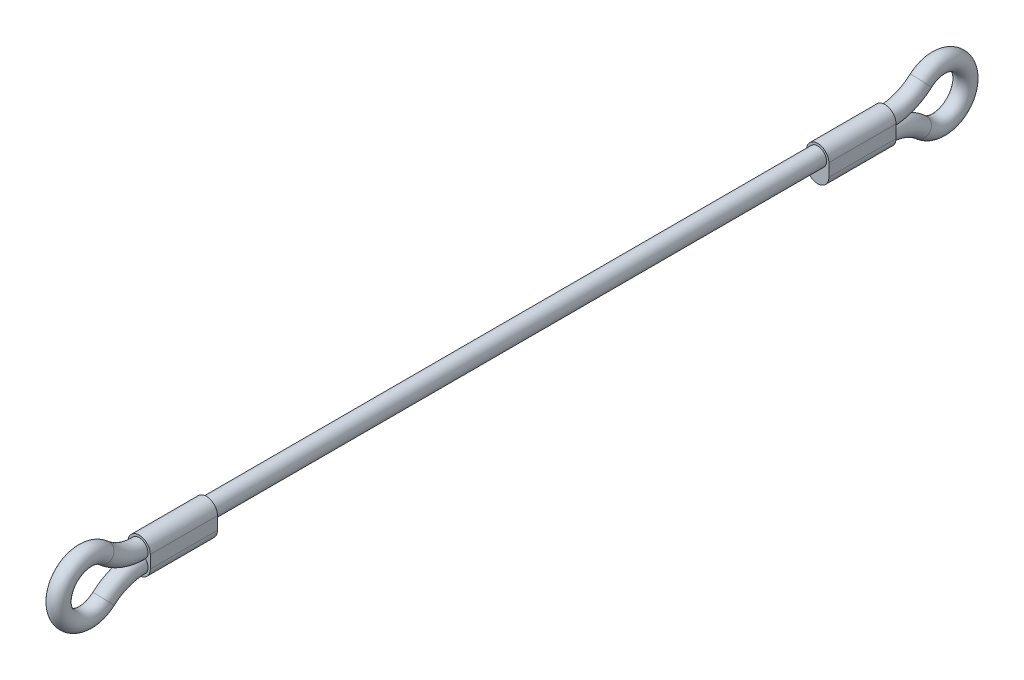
ISO-10303-21;
HEADER;
FILE_DESCRIPTION(('STEP AP214'),'2;1');
FILE_NAME('part.step','',(''),(''),'','','');
FILE_SCHEMA(('AUTOMOTIVE_DESIGN { 1 0 10303 214 1 1 1 1 }'));
ENDSEC;
DATA;
#1=APPLICATION_CONTEXT('core data for automotive mechanical design processes');
#2=APPLICATION_PROTOCOL_DEFINITION('international standard','automotive_design',2000,#1);
#3=PRODUCT_CONTEXT('',#1,'mechanical');
#4=PRODUCT('Part','Part','',(#3));
#5=PRODUCT_RELATED_PRODUCT_CATEGORY('part','',(#4));
#6=PRODUCT_DEFINITION_FORMATION('','',#4);
#7=PRODUCT_DEFINITION_CONTEXT('part definition',#1,'design');
#8=PRODUCT_DEFINITION('design','',#6,#7);
#9=PRODUCT_DEFINITION_SHAPE('','',#8);
#10=(LENGTH_UNIT() NAMED_UNIT(*) SI_UNIT(.MILLI.,.METRE.));
#11=(NAMED_UNIT(*) PLANE_ANGLE_UNIT() SI_UNIT($,.RADIAN.));
#12=(NAMED_UNIT(*) SI_UNIT($,.STERADIAN.) SOLID_ANGLE_UNIT());
#13=UNCERTAINTY_MEASURE_WITH_UNIT(LENGTH_MEASURE(1.E-05),#10,'distance_accuracy_value','');
#14=(GEOMETRIC_REPRESENTATION_CONTEXT(3) GLOBAL_UNCERTAINTY_ASSIGNED_CONTEXT((#13)) GLOBAL_UNIT_ASSIGNED_CONTEXT((#10,
#11,#12)) REPRESENTATION_CONTEXT('',''));
#15=CARTESIAN_POINT('',(0.,0.,0.));
#16=DIRECTION('',(0.,0.,1.));
#17=DIRECTION('',(1.,0.,0.));
#18=AXIS2_PLACEMENT_3D('',#15,#16,#17);
#19=CARTESIAN_POINT('',(0.,0.,-66.6));
#20=DIRECTION('',(0.,0.,1.));
#21=DIRECTION('',(1.,0.,0.));
#22=AXIS2_PLACEMENT_3D('',#19,#20,#21);
#23=CYLINDRICAL_SURFACE('',#22,1.59);
#24=CARTESIAN_POINT('',(0.,0.,-54.6));
#25=DIRECTION('',(0.,0.,1.));
#26=DIRECTION('',(0.,-1.,0.));
#27=AXIS2_PLACEMENT_3D('',#24,#25,#26);
#28=CIRCLE('',#27,1.59);
#29=CARTESIAN_POINT('',(0.,-1.59,-54.6));
#30=VERTEX_POINT('',#29);
#31=EDGE_CURVE('E11',#30,#30,#28,.F.);
#32=ORIENTED_EDGE('',*,*,#31,.F.);
#33=EDGE_LOOP('',(#32));
#34=FACE_BOUND('',#33,.T.);
#35=CARTESIAN_POINT('',(0.,0.,54.6));
#36=DIRECTION('',(0.,0.,-1.));
#37=DIRECTION('',(0.,1.,0.));
#38=AXIS2_PLACEMENT_3D('',#35,#36,#37);
#39=CIRCLE('',#38,1.59);
#40=CARTESIAN_POINT('',(0.,1.59,54.6));
#41=VERTEX_POINT('',#40);
#42=EDGE_CURVE('E51',#41,#41,#39,.F.);
#43=ORIENTED_EDGE('',*,*,#42,.F.);
#44=EDGE_LOOP('',(#43));
#45=FACE_BOUND('',#44,.T.);
#46=ADVANCED_FACE('F41',(#34,#45),#23,.T.);
#47=CARTESIAN_POINT('',(0.,0.,54.6));
#48=DIRECTION('',(0.,0.,1.));
#49=DIRECTION('',(0.,-1.,0.));
#50=AXIS2_PLACEMENT_3D('',#47,#48,#49);
#51=CYLINDRICAL_SURFACE('',#50,1.995);
#52=CARTESIAN_POINT('',(0.,0.,66.6));
#53=DIRECTION('',(0.,0.,-1.));
#54=DIRECTION('',(0.,1.,0.));
#55=AXIS2_PLACEMENT_3D('',#52,#53,#54);
#56=CIRCLE('',#55,1.995);
#57=CARTESIAN_POINT('',(-1.995,0.,66.6));
#58=VERTEX_POINT('',#57);
#59=CARTESIAN_POINT('',(1.995,0.,66.6));
#60=VERTEX_POINT('',#59);
#61=EDGE_CURVE('E134',#58,#60,#56,.T.);
#62=ORIENTED_EDGE('',*,*,#61,.T.);
#63=DIRECTION('',(0.,0.,1.));
#64=VECTOR('',#63,1.);
#65=CARTESIAN_POINT('',(1.995,0.,54.6));
#66=LINE('',#65,#64);
#67=CARTESIAN_POINT('',(1.995,0.,54.6));
#68=VERTEX_POINT('',#67);
#69=EDGE_CURVE('E214',#68,#60,#66,.T.);
#70=ORIENTED_EDGE('',*,*,#69,.F.);
#71=CARTESIAN_POINT('',(0.,0.,54.6));
#72=DIRECTION('',(0.,0.,-1.));
#73=DIRECTION('',(0.,1.,0.));
#74=AXIS2_PLACEMENT_3D('',#71,#72,#73);
#75=CIRCLE('',#74,1.995);
#76=CARTESIAN_POINT('',(-1.995,0.,54.6));
#77=VERTEX_POINT('',#76);
#78=EDGE_CURVE('E178',#77,#68,#75,.T.);
#79=ORIENTED_EDGE('',*,*,#78,.F.);
#80=DIRECTION('',(0.,0.,1.));
#81=VECTOR('',#80,1.);
#82=CARTESIAN_POINT('',(-1.995,0.,54.6));
#83=LINE('',#82,#81);
#84=EDGE_CURVE('E191',#77,#58,#83,.T.);
#85=ORIENTED_EDGE('',*,*,#84,.T.);
#86=EDGE_LOOP('',(#62,#70,#79,#85));
#87=FACE_BOUND('',#86,.T.);
#88=ADVANCED_FACE('F278',(#87),#51,.T.);
#89=CARTESIAN_POINT('',(1.995,0.,54.6));
#90=DIRECTION('',(-1.,0.,0.));
#91=DIRECTION('',(0.,0.,1.));
#92=AXIS2_PLACEMENT_3D('',#89,#90,#91);
#93=PLANE('',#92);
#94=DIRECTION('',(0.,-1.,0.));
#95=VECTOR('',#94,1.);
#96=CARTESIAN_POINT('',(1.995,0.,66.6));
#97=LINE('',#96,#95);
#98=CARTESIAN_POINT('',(1.995,-2.26625258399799,66.6));
#99=VERTEX_POINT('',#98);
#100=EDGE_CURVE('E195',#60,#99,#97,.T.);
#101=ORIENTED_EDGE('',*,*,#100,.T.);
#102=DIRECTION('',(0.,0.,1.));
#103=VECTOR('',#102,1.);
#104=CARTESIAN_POINT('',(1.995,-2.26625258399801,54.6));
#105=LINE('',#104,#103);
#106=CARTESIAN_POINT('',(1.995,-2.26625258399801,54.6));
#107=VERTEX_POINT('',#106);
#108=EDGE_CURVE('E210',#107,#99,#105,.T.);
#109=ORIENTED_EDGE('',*,*,#108,.F.);
#110=DIRECTION('',(0.,-1.,0.));
#111=VECTOR('',#110,1.);
#112=CARTESIAN_POINT('',(1.995,0.,54.6));
#113=LINE('',#112,#111);
#114=EDGE_CURVE('E182',#68,#107,#113,.T.);
#115=ORIENTED_EDGE('',*,*,#114,.F.);
#116=ORIENTED_EDGE('',*,*,#69,.T.);
#117=EDGE_LOOP('',(#101,#109,#115,#116));
#118=FACE_BOUND('',#117,.T.);
#119=ADVANCED_FACE('F283',(#118),#93,.F.);
#120=CARTESIAN_POINT('',(0.,-2.26625258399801,54.6));
#121=DIRECTION('',(0.,0.,1.));
#122=DIRECTION('',(0.,-1.,0.));
#123=AXIS2_PLACEMENT_3D('',#120,#121,#122);
#124=CYLINDRICAL_SURFACE('',#123,1.995);
#125=CARTESIAN_POINT('',(0.,-2.26625258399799,66.6));
#126=DIRECTION('',(0.,0.,-1.));
#127=DIRECTION('',(0.,1.,0.));
#128=AXIS2_PLACEMENT_3D('',#125,#126,#127);
#129=CIRCLE('',#128,1.995);
#130=CARTESIAN_POINT('',(-1.995,-2.26625258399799,66.6));
#131=VERTEX_POINT('',#130);
#132=EDGE_CURVE('E198',#99,#131,#129,.T.);
#133=ORIENTED_EDGE('',*,*,#132,.T.);
#134=DIRECTION('',(0.,0.,1.));
#135=VECTOR('',#134,1.);
#136=CARTESIAN_POINT('',(-1.995,-2.26625258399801,54.6));
#137=LINE('',#136,#135);
#138=CARTESIAN_POINT('',(-1.995,-2.26625258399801,54.6));
#139=VERTEX_POINT('',#138);
#140=EDGE_CURVE('E206',#139,#131,#137,.T.);
#141=ORIENTED_EDGE('',*,*,#140,.F.);
#142=CARTESIAN_POINT('',(0.,-2.26625258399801,54.6));
#143=DIRECTION('',(0.,0.,-1.));
#144=DIRECTION('',(0.,1.,0.));
#145=AXIS2_PLACEMENT_3D('',#142,#143,#144);
#146=CIRCLE('',#145,1.995);
#147=EDGE_CURVE('E186',#107,#139,#146,.T.);
#148=ORIENTED_EDGE('',*,*,#147,.F.);
#149=ORIENTED_EDGE('',*,*,#108,.T.);
#150=EDGE_LOOP('',(#133,#141,#148,#149));
#151=FACE_BOUND('',#150,.T.);
#152=ADVANCED_FACE('F324',(#151),#124,.T.);
#153=CARTESIAN_POINT('',(-1.995,0.,54.6));
#154=DIRECTION('',(1.,0.,0.));
#155=DIRECTION('',(0.,1.,0.));
#156=AXIS2_PLACEMENT_3D('',#153,#154,#155);
#157=PLANE('',#156);
#158=DIRECTION('',(0.,1.,0.));
#159=VECTOR('',#158,1.);
#160=CARTESIAN_POINT('',(-1.995,0.,66.6));
#161=LINE('',#160,#159);
#162=EDGE_CURVE('E183',#131,#58,#161,.T.);
#163=ORIENTED_EDGE('',*,*,#162,.T.);
#164=ORIENTED_EDGE('',*,*,#84,.F.);
#165=DIRECTION('',(0.,1.,0.));
#166=VECTOR('',#165,1.);
#167=CARTESIAN_POINT('',(-1.995,0.,54.6));
#168=LINE('',#167,#166);
#169=EDGE_CURVE('E189',#139,#77,#168,.T.);
#170=ORIENTED_EDGE('',*,*,#169,.F.);
#171=ORIENTED_EDGE('',*,*,#140,.T.);
#172=EDGE_LOOP('',(#163,#164,#170,#171));
#173=FACE_BOUND('',#172,.T.);
#174=ADVANCED_FACE('F320',(#173),#157,.F.);
#175=CARTESIAN_POINT('',(0.,0.,54.6));
#176=DIRECTION('',(0.,0.,-1.));
#177=DIRECTION('',(0.,1.,0.));
#178=AXIS2_PLACEMENT_3D('',#175,#176,#177);
#179=PLANE('',#178);
#180=ORIENTED_EDGE('',*,*,#42,.T.);
#181=EDGE_LOOP('',(#180));
#182=FACE_BOUND('',#181,.T.);
#183=ORIENTED_EDGE('',*,*,#78,.T.);
#184=ORIENTED_EDGE('',*,*,#114,.T.);
#185=ORIENTED_EDGE('',*,*,#147,.T.);
#186=ORIENTED_EDGE('',*,*,#169,.T.);
#187=EDGE_LOOP('',(#183,#184,#185,#186));
#188=FACE_BOUND('',#187,.T.);
#189=ADVANCED_FACE('F272',(#182,#188),#179,.T.);
#190=CARTESIAN_POINT('',(0.,0.,66.6));
#191=DIRECTION('',(0.,0.,-1.));
#192=DIRECTION('',(0.,1.,0.));
#193=AXIS2_PLACEMENT_3D('',#190,#191,#192);
#194=PLANE('',#193);
#195=CARTESIAN_POINT('',(0.,0.,66.6));
#196=DIRECTION('',(0.,0.,1.));
#197=DIRECTION('',(1.,0.,0.));
#198=AXIS2_PLACEMENT_3D('',#195,#196,#197);
#199=CIRCLE('',#198,1.59);
#200=CARTESIAN_POINT('',(1.11540342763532,-1.13312629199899,66.6));
#201=VERTEX_POINT('',#200);
#202=CARTESIAN_POINT('',(-1.11540342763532,-1.133126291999,66.6));
#203=VERTEX_POINT('',#202);
#204=EDGE_CURVE('E231',#201,#203,#199,.T.);
#205=ORIENTED_EDGE('',*,*,#204,.F.);
#206=CARTESIAN_POINT('',(0.,-2.26625258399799,66.6));
#207=DIRECTION('',(0.,0.,-1.));
#208=DIRECTION('',(1.,0.,0.));
#209=AXIS2_PLACEMENT_3D('',#206,#207,#208);
#210=CIRCLE('',#209,1.59);
#211=EDGE_CURVE('E64',#201,#203,#210,.T.);
#212=ORIENTED_EDGE('',*,*,#211,.T.);
#213=EDGE_LOOP('',(#205,#212));
#214=FACE_BOUND('',#213,.T.);
#215=ORIENTED_EDGE('',*,*,#61,.F.);
#216=ORIENTED_EDGE('',*,*,#162,.F.);
#217=ORIENTED_EDGE('',*,*,#132,.F.);
#218=ORIENTED_EDGE('',*,*,#100,.F.);
#219=EDGE_LOOP('',(#215,#216,#217,#218));
#220=FACE_BOUND('',#219,.T.);
#221=ADVANCED_FACE('F266',(#214,#220),#194,.F.);
#222=CARTESIAN_POINT('',(0.,-1.13312629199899,76.2));
#223=DIRECTION('',(1.,0.,0.));
#224=DIRECTION('',(0.,0.,-1.));
#225=AXIS2_PLACEMENT_3D('',#222,#223,#224);
#226=TOROIDAL_SURFACE('',#225,4.8,1.59);
#227=CARTESIAN_POINT('',(0.,2.44458247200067,73.));
#228=DIRECTION('',(0.,0.666666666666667,0.74535599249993));
#229=DIRECTION('',(1.,0.,0.));
#230=AXIS2_PLACEMENT_3D('',#227,#228,#229);
#231=CIRCLE('',#230,1.59);
#232=CARTESIAN_POINT('',(0.,3.62969850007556,71.94));
#233=VERTEX_POINT('',#232);
#234=EDGE_CURVE('E234',#233,#233,#231,.T.);
#235=CARTESIAN_POINT('',(0.,-4.71083505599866,73.));
#236=DIRECTION('',(0.,0.666666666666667,-0.74535599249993));
#237=DIRECTION('',(1.,0.,0.));
#238=AXIS2_PLACEMENT_3D('',#235,#236,#237);
#239=CIRCLE('',#238,1.59);
#240=CARTESIAN_POINT('',(0.,-5.89595108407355,71.94));
#241=VERTEX_POINT('',#240);
#242=EDGE_CURVE('E238',#241,#241,#239,.T.);
#243=CARTESIAN_POINT('',(0.,-1.13312629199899,76.2));
#244=DIRECTION('',(1.,0.,0.));
#245=DIRECTION('',(0.,0.,-1.));
#246=AXIS2_PLACEMENT_3D('',#243,#244,#245);
#247=CIRCLE('',#246,6.39);
#248=EDGE_CURVE('',#233,#241,#247,.T.);
#249=ORIENTED_EDGE('',*,*,#234,.T.);
#250=ORIENTED_EDGE('',*,*,#242,.F.);
#251=ORIENTED_EDGE('',*,*,#248,.T.);
#252=ORIENTED_EDGE('',*,*,#248,.F.);
#253=EDGE_LOOP('',(#249,#251,#250,#252));
#254=FACE_BOUND('',#253,.T.);
#255=ADVANCED_FACE('F264',(#254),#226,.T.);
#256=CARTESIAN_POINT('',(0.,-11.866252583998,66.6));
#257=DIRECTION('',(-1.,0.,0.));
#258=DIRECTION('',(0.,0.,1.));
#259=AXIS2_PLACEMENT_3D('',#256,#257,#258);
#260=TOROIDAL_SURFACE('',#259,9.59999999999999,1.59);
#261=CARTESIAN_POINT('',(-1.11540342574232,-1.13312629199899,66.5998));
#262=CARTESIAN_POINT('',(-1.11534851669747,-1.133126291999,66.72773673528));
#263=CARTESIAN_POINT('',(-1.11308141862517,-1.133126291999,66.8556863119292));
#264=CARTESIAN_POINT('',(-1.10371453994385,-1.133126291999,67.1115582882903));
#265=CARTESIAN_POINT('',(-1.09660901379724,-1.13312629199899,67.2394804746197));
#266=CARTESIAN_POINT('',(-1.07704253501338,-1.13312629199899,67.4964186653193));
#267=CARTESIAN_POINT('',(-1.06452051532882,-1.13312629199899,67.6254301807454));
#268=CARTESIAN_POINT('',(-1.03319430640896,-1.13312629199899,67.8826272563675));
#269=CARTESIAN_POINT('',(-1.01439338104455,-1.13312629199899,68.0108132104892));
#270=CARTESIAN_POINT('',(-0.966908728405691,-1.13312629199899,68.2780053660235));
#271=CARTESIAN_POINT('',(-0.937456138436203,-1.13312629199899,68.4168833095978));
#272=CARTESIAN_POINT('',(-0.883915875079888,-1.13312629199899,68.6226312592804));
#273=CARTESIAN_POINT('',(-0.864530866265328,-1.13312629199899,68.6907246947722));
#274=CARTESIAN_POINT('',(-0.821996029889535,-1.13312629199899,68.8257156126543));
#275=CARTESIAN_POINT('',(-0.79884765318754,-1.13312629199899,68.892613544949));
#276=CARTESIAN_POINT('',(-0.744519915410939,-1.13312629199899,69.0335421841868));
#277=CARTESIAN_POINT('',(-0.712679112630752,-1.13312629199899,69.107321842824));
#278=CARTESIAN_POINT('',(-0.641279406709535,-1.13312629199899,69.2511461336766));
#279=CARTESIAN_POINT('',(-0.601727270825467,-1.13312629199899,69.321193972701));
#280=CARTESIAN_POINT('',(-0.528948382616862,-1.13312629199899,69.4294356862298));
#281=CARTESIAN_POINT('',(-0.498892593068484,-1.13312629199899,69.469741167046));
#282=CARTESIAN_POINT('',(-0.433770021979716,-1.13312629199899,69.5461405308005));
#283=CARTESIAN_POINT('',(-0.39871096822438,-1.13312629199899,69.5822407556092));
#284=CARTESIAN_POINT('',(-0.335060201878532,-1.13312629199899,69.6370580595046));
#285=CARTESIAN_POINT('',(-0.308066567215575,-1.13312629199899,69.6576127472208));
#286=CARTESIAN_POINT('',(-0.251279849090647,-1.13312629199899,69.6944335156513));
#287=CARTESIAN_POINT('',(-0.221491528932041,-1.13312629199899,69.7107067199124));
#288=CARTESIAN_POINT('',(-0.165682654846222,-1.13312629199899,69.7347979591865));
#289=CARTESIAN_POINT('',(-0.140117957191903,-1.13312629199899,69.7436602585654));
#290=CARTESIAN_POINT('',(-0.0878641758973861,-1.13312629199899,69.7569907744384));
#291=CARTESIAN_POINT('',(-0.0611762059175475,-1.13312629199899,69.7614632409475));
#292=CARTESIAN_POINT('',(-0.00731772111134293,-1.13312629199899,69.765572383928));
#293=CARTESIAN_POINT('',(0.0198542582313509,-1.13312629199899,69.7651903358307));
#294=CARTESIAN_POINT('',(0.073695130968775,-1.13312629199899,69.7595861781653));
#295=CARTESIAN_POINT('',(0.100363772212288,-1.13312629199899,69.7543617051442));
#296=CARTESIAN_POINT('',(0.151195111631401,-1.13312629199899,69.7399571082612));
#297=CARTESIAN_POINT('',(0.175416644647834,-1.13312629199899,69.7309793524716));
#298=CARTESIAN_POINT('',(0.222373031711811,-1.13312629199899,69.7097742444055));
#299=CARTESIAN_POINT('',(0.245107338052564,-1.13312629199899,69.6975457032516));
#300=CARTESIAN_POINT('',(0.30475923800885,-1.13312629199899,69.6607488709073));
#301=CARTESIAN_POINT('',(0.340101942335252,-1.13312629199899,69.6336356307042));
#302=CARTESIAN_POINT('',(0.406281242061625,-1.13312629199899,69.57436880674));
#303=CARTESIAN_POINT('',(0.437102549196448,-1.13312629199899,69.5421988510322));
#304=CARTESIAN_POINT('',(0.492718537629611,-1.13312629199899,69.4770136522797));
#305=CARTESIAN_POINT('',(0.517788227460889,-1.13312629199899,69.4442290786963));
#306=CARTESIAN_POINT('',(0.565060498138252,-1.13312629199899,69.3766392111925));
#307=CARTESIAN_POINT('',(0.587260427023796,-1.13312629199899,69.3418320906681));
#308=CARTESIAN_POINT('',(0.650275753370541,-1.13312629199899,69.2351509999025));
#309=CARTESIAN_POINT('',(0.687428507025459,-1.13312629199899,69.1611160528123));
#310=CARTESIAN_POINT('',(0.745434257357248,-1.13312629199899,69.0302751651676));
#311=CARTESIAN_POINT('',(0.767985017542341,-1.13312629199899,68.9741824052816));
#312=CARTESIAN_POINT('',(0.809859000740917,-1.13312629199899,68.8607969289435));
#313=CARTESIAN_POINT('',(0.829181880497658,-1.13312629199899,68.8035040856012));
#314=CARTESIAN_POINT('',(0.883166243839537,-1.13312629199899,68.6301731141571));
#315=CARTESIAN_POINT('',(0.913763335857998,-1.13312629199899,68.5128746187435));
#316=CARTESIAN_POINT('',(0.967023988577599,-1.13312629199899,68.2759552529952));
#317=CARTESIAN_POINT('',(0.989647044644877,-1.13312629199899,68.156325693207));
#318=CARTESIAN_POINT('',(1.02845868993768,-1.13312629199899,67.9160128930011));
#319=CARTESIAN_POINT('',(1.04464572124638,-1.13312629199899,67.7953294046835));
#320=CARTESIAN_POINT('',(1.068187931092,-1.13312629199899,67.5845366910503));
#321=CARTESIAN_POINT('',(1.07674400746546,-1.13312629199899,67.4945564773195));
#322=CARTESIAN_POINT('',(1.09119671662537,-1.13312629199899,67.3143675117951));
#323=CARTESIAN_POINT('',(1.09709289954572,-1.13312629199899,67.2241587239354));
#324=CARTESIAN_POINT('',(1.10635885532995,-1.13312629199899,67.0449391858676));
#325=CARTESIAN_POINT('',(1.10976438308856,-1.13312629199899,66.9559302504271));
#326=CARTESIAN_POINT('',(1.11428069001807,-1.13312629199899,66.7778802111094));
#327=CARTESIAN_POINT('',(1.11539214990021,-1.13312629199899,66.688839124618));
#328=CARTESIAN_POINT('',(1.11540342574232,-1.133126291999,66.5998));
#329=B_SPLINE_CURVE_WITH_KNOTS('',3,(#261,#262,#263,#264,#265,#266,#267,#268,#269,#270,#271,
#272,#273,#274,#275,#276,#277,#278,#279,#280,#281,#282,#283,#284,#285,#286,#287,#288,#289,#290,
#291,#292,#293,#294,#295,#296,#297,#298,#299,#300,#301,#302,#303,#304,#305,#306,#307,#308,#309,
#310,#311,#312,#313,#314,#315,#316,#317,#318,#319,#320,#321,#322,#323,#324,#325,#326,#327,#328),
.UNSPECIFIED.,.F.,.F.,(4,2,2,2,2,2,2,2,2,2,2,2,2,2,2,2,2,2,2,2,2,2,2,2,2,2,2,2,2,2,2,2,2,4),(0.,
0.383810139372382,0.76807684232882,1.15679365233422,1.54530871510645,1.97071269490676,
2.18302701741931,2.39525968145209,2.63604166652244,2.87661329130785,3.02716706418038,
3.17749076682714,3.27898827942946,3.3803158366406,3.46115731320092,3.54192044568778,
3.62299518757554,3.70410952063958,3.78132200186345,3.85856276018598,3.99142265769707,
4.12472192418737,4.24834991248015,4.37209134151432,4.61994843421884,4.80123584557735,
4.98254252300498,5.34577733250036,5.71083149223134,6.07597396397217,6.34709439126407,
6.61826065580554,6.88545336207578,7.15256677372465),.UNSPECIFIED.);
#330=EDGE_CURVE('E244',#203,#201,#329,.T.);
#331=ORIENTED_EDGE('',*,*,#330,.F.);
#332=ORIENTED_EDGE('',*,*,#211,.F.);
#333=EDGE_LOOP('',(#331,#332));
#334=FACE_BOUND('',#333,.T.);
#335=ORIENTED_EDGE('',*,*,#242,.T.);
#336=EDGE_LOOP('',(#335));
#337=FACE_BOUND('',#336,.T.);
#338=ADVANCED_FACE('F43',(#334,#337),#260,.T.);
#339=CARTESIAN_POINT('',(0.,9.59999999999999,66.6));
#340=DIRECTION('',(-1.,0.,0.));
#341=DIRECTION('',(0.,0.,1.));
#342=AXIS2_PLACEMENT_3D('',#339,#340,#341);
#343=TOROIDAL_SURFACE('',#342,9.59999999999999,1.59);
#344=ORIENTED_EDGE('',*,*,#234,.F.);
#345=EDGE_LOOP('',(#344));
#346=FACE_BOUND('',#345,.T.);
#347=ORIENTED_EDGE('',*,*,#204,.T.);
#348=ORIENTED_EDGE('',*,*,#330,.T.);
#349=EDGE_LOOP('',(#347,#348));
#350=FACE_BOUND('',#349,.T.);
#351=ADVANCED_FACE('F259',(#346,#350),#343,.T.);
#352=CARTESIAN_POINT('',(0.,0.,-54.6));
#353=DIRECTION('',(0.,0.,-1.));
#354=DIRECTION('',(0.,1.,0.));
#355=AXIS2_PLACEMENT_3D('',#352,#353,#354);
#356=CYLINDRICAL_SURFACE('',#355,1.995);
#357=CARTESIAN_POINT('',(0.,0.,-66.6));
#358=DIRECTION('',(0.,0.,-1.));
#359=DIRECTION('',(0.,1.,0.));
#360=AXIS2_PLACEMENT_3D('',#357,#358,#359);
#361=CIRCLE('',#360,1.995);
#362=CARTESIAN_POINT('',(-1.995,0.,-66.6));
#363=VERTEX_POINT('',#362);
#364=CARTESIAN_POINT('',(1.995,0.,-66.6));
#365=VERTEX_POINT('',#364);
#366=EDGE_CURVE('E128',#363,#365,#361,.T.);
#367=ORIENTED_EDGE('',*,*,#366,.F.);
#368=DIRECTION('',(0.,0.,-1.));
#369=VECTOR('',#368,1.);
#370=CARTESIAN_POINT('',(-1.995,0.,-54.6));
#371=LINE('',#370,#369);
#372=CARTESIAN_POINT('',(-1.995,0.,-54.6));
#373=VERTEX_POINT('',#372);
#374=EDGE_CURVE('E122',#373,#363,#371,.T.);
#375=ORIENTED_EDGE('',*,*,#374,.F.);
#376=CARTESIAN_POINT('',(0.,0.,-54.6));
#377=DIRECTION('',(0.,0.,-1.));
#378=DIRECTION('',(0.,1.,0.));
#379=AXIS2_PLACEMENT_3D('',#376,#377,#378);
#380=CIRCLE('',#379,1.995);
#381=CARTESIAN_POINT('',(1.995,0.,-54.6));
#382=VERTEX_POINT('',#381);
#383=EDGE_CURVE('E125',#373,#382,#380,.T.);
#384=ORIENTED_EDGE('',*,*,#383,.T.);
#385=DIRECTION('',(0.,0.,-1.));
#386=VECTOR('',#385,1.);
#387=CARTESIAN_POINT('',(1.995,0.,-54.6));
#388=LINE('',#387,#386);
#389=EDGE_CURVE('E158',#382,#365,#388,.T.);
#390=ORIENTED_EDGE('',*,*,#389,.T.);
#391=EDGE_LOOP('',(#367,#375,#384,#390));
#392=FACE_BOUND('',#391,.T.);
#393=ADVANCED_FACE('F124',(#392),#356,.T.);
#394=CARTESIAN_POINT('',(-1.995,0.,-54.6));
#395=DIRECTION('',(-1.,0.,0.));
#396=DIRECTION('',(0.,-1.,0.));
#397=AXIS2_PLACEMENT_3D('',#394,#395,#396);
#398=PLANE('',#397);
#399=DIRECTION('',(0.,1.,0.));
#400=VECTOR('',#399,1.);
#401=CARTESIAN_POINT('',(-1.995,0.,-66.6));
#402=LINE('',#401,#400);
#403=CARTESIAN_POINT('',(-1.995,-2.26625258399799,-66.6));
#404=VERTEX_POINT('',#403);
#405=EDGE_CURVE('E161',#404,#363,#402,.T.);
#406=ORIENTED_EDGE('',*,*,#405,.F.);
#407=DIRECTION('',(0.,0.,-1.));
#408=VECTOR('',#407,1.);
#409=CARTESIAN_POINT('',(-1.995,-2.26625258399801,-54.6));
#410=LINE('',#409,#408);
#411=CARTESIAN_POINT('',(-1.995,-2.26625258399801,-54.6));
#412=VERTEX_POINT('',#411);
#413=EDGE_CURVE('E135',#412,#404,#410,.T.);
#414=ORIENTED_EDGE('',*,*,#413,.F.);
#415=DIRECTION('',(0.,1.,0.));
#416=VECTOR('',#415,1.);
#417=CARTESIAN_POINT('',(-1.995,0.,-54.6));
#418=LINE('',#417,#416);
#419=EDGE_CURVE('E141',#412,#373,#418,.T.);
#420=ORIENTED_EDGE('',*,*,#419,.T.);
#421=ORIENTED_EDGE('',*,*,#374,.T.);
#422=EDGE_LOOP('',(#406,#414,#420,#421));
#423=FACE_BOUND('',#422,.T.);
#424=ADVANCED_FACE('F148',(#423),#398,.T.);
#425=CARTESIAN_POINT('',(0.,-2.26625258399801,-54.6));
#426=DIRECTION('',(0.,0.,-1.));
#427=DIRECTION('',(0.,1.,0.));
#428=AXIS2_PLACEMENT_3D('',#425,#426,#427);
#429=CYLINDRICAL_SURFACE('',#428,1.995);
#430=CARTESIAN_POINT('',(0.,-2.26625258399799,-66.6));
#431=DIRECTION('',(0.,0.,-1.));
#432=DIRECTION('',(0.,1.,0.));
#433=AXIS2_PLACEMENT_3D('',#430,#431,#432);
#434=CIRCLE('',#433,1.995);
#435=CARTESIAN_POINT('',(1.995,-2.26625258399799,-66.6));
#436=VERTEX_POINT('',#435);
#437=EDGE_CURVE('E164',#436,#404,#434,.T.);
#438=ORIENTED_EDGE('',*,*,#437,.F.);
#439=DIRECTION('',(0.,0.,-1.));
#440=VECTOR('',#439,1.);
#441=CARTESIAN_POINT('',(1.995,-2.26625258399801,-54.6));
#442=LINE('',#441,#440);
#443=CARTESIAN_POINT('',(1.995,-2.26625258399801,-54.6));
#444=VERTEX_POINT('',#443);
#445=EDGE_CURVE('E173',#444,#436,#442,.T.);
#446=ORIENTED_EDGE('',*,*,#445,.F.);
#447=CARTESIAN_POINT('',(0.,-2.26625258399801,-54.6));
#448=DIRECTION('',(0.,0.,-1.));
#449=DIRECTION('',(0.,1.,0.));
#450=AXIS2_PLACEMENT_3D('',#447,#448,#449);
#451=CIRCLE('',#450,1.995);
#452=EDGE_CURVE('E150',#444,#412,#451,.T.);
#453=ORIENTED_EDGE('',*,*,#452,.T.);
#454=ORIENTED_EDGE('',*,*,#413,.T.);
#455=EDGE_LOOP('',(#438,#446,#453,#454));
#456=FACE_BOUND('',#455,.T.);
#457=ADVANCED_FACE('F307',(#456),#429,.T.);
#458=CARTESIAN_POINT('',(1.995,0.,-54.6));
#459=DIRECTION('',(1.,0.,0.));
#460=DIRECTION('',(0.,0.,-1.));
#461=AXIS2_PLACEMENT_3D('',#458,#459,#460);
#462=PLANE('',#461);
#463=DIRECTION('',(0.,-1.,0.));
#464=VECTOR('',#463,1.);
#465=CARTESIAN_POINT('',(1.995,0.,-66.6));
#466=LINE('',#465,#464);
#467=EDGE_CURVE('E146',#365,#436,#466,.T.);
#468=ORIENTED_EDGE('',*,*,#467,.F.);
#469=ORIENTED_EDGE('',*,*,#389,.F.);
#470=DIRECTION('',(0.,-1.,0.));
#471=VECTOR('',#470,1.);
#472=CARTESIAN_POINT('',(1.995,0.,-54.6));
#473=LINE('',#472,#471);
#474=EDGE_CURVE('E144',#382,#444,#473,.T.);
#475=ORIENTED_EDGE('',*,*,#474,.T.);
#476=ORIENTED_EDGE('',*,*,#445,.T.);
#477=EDGE_LOOP('',(#468,#469,#475,#476));
#478=FACE_BOUND('',#477,.T.);
#479=ADVANCED_FACE('F304',(#478),#462,.T.);
#480=CARTESIAN_POINT('',(0.,0.,-54.6));
#481=DIRECTION('',(0.,0.,1.));
#482=DIRECTION('',(0.,1.,0.));
#483=AXIS2_PLACEMENT_3D('',#480,#481,#482);
#484=PLANE('',#483);
#485=ORIENTED_EDGE('',*,*,#31,.T.);
#486=EDGE_LOOP('',(#485));
#487=FACE_BOUND('',#486,.T.);
#488=ORIENTED_EDGE('',*,*,#383,.F.);
#489=ORIENTED_EDGE('',*,*,#419,.F.);
#490=ORIENTED_EDGE('',*,*,#452,.F.);
#491=ORIENTED_EDGE('',*,*,#474,.F.);
#492=EDGE_LOOP('',(#488,#489,#490,#491));
#493=FACE_BOUND('',#492,.T.);
#494=ADVANCED_FACE('F139',(#487,#493),#484,.T.);
#495=CARTESIAN_POINT('',(0.,0.,-66.6));
#496=DIRECTION('',(0.,0.,1.));
#497=DIRECTION('',(0.,1.,0.));
#498=AXIS2_PLACEMENT_3D('',#495,#496,#497);
#499=PLANE('',#498);
#500=CARTESIAN_POINT('',(0.,-2.26625258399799,-66.6));
#501=DIRECTION('',(0.,0.,-1.));
#502=DIRECTION('',(1.,0.,0.));
#503=AXIS2_PLACEMENT_3D('',#500,#501,#502);
#504=CIRCLE('',#503,1.59);
#505=CARTESIAN_POINT('',(1.11540342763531,-1.133126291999,-66.6));
#506=VERTEX_POINT('',#505);
#507=CARTESIAN_POINT('',(-1.11540342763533,-1.13312629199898,-66.6));
#508=VERTEX_POINT('',#507);
#509=EDGE_CURVE('E218',#506,#508,#504,.T.);
#510=ORIENTED_EDGE('',*,*,#509,.F.);
#511=CARTESIAN_POINT('',(0.,0.,-66.6));
#512=DIRECTION('',(0.,0.,1.));
#513=DIRECTION('',(1.,0.,0.));
#514=AXIS2_PLACEMENT_3D('',#511,#512,#513);
#515=CIRCLE('',#514,1.59);
#516=EDGE_CURVE('E57',#506,#508,#515,.T.);
#517=ORIENTED_EDGE('',*,*,#516,.T.);
#518=EDGE_LOOP('',(#510,#517));
#519=FACE_BOUND('',#518,.T.);
#520=ORIENTED_EDGE('',*,*,#366,.T.);
#521=ORIENTED_EDGE('',*,*,#467,.T.);
#522=ORIENTED_EDGE('',*,*,#437,.T.);
#523=ORIENTED_EDGE('',*,*,#405,.T.);
#524=EDGE_LOOP('',(#520,#521,#522,#523));
#525=FACE_BOUND('',#524,.T.);
#526=ADVANCED_FACE('F297',(#519,#525),#499,.F.);
#527=CARTESIAN_POINT('',(0.,-1.13312629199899,-76.2));
#528=DIRECTION('',(1.,0.,0.));
#529=DIRECTION('',(0.,0.,-1.));
#530=AXIS2_PLACEMENT_3D('',#527,#528,#529);
#531=TOROIDAL_SURFACE('',#530,4.8,1.59);
#532=CARTESIAN_POINT('',(0.,-4.71083505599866,-73.));
#533=DIRECTION('',(0.,-0.666666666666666,-0.745355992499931));
#534=DIRECTION('',(1.,0.,0.));
#535=AXIS2_PLACEMENT_3D('',#532,#533,#534);
#536=CIRCLE('',#535,1.59);
#537=CARTESIAN_POINT('',(0.,-5.89595108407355,-71.94));
#538=VERTEX_POINT('',#537);
#539=EDGE_CURVE('E221',#538,#538,#536,.T.);
#540=CARTESIAN_POINT('',(0.,2.44458247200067,-73.));
#541=DIRECTION('',(0.,-0.666666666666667,0.74535599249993));
#542=DIRECTION('',(1.,0.,0.));
#543=AXIS2_PLACEMENT_3D('',#540,#541,#542);
#544=CIRCLE('',#543,1.59);
#545=CARTESIAN_POINT('',(0.,3.62969850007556,-71.94));
#546=VERTEX_POINT('',#545);
#547=EDGE_CURVE('E225',#546,#546,#544,.T.);
#548=CARTESIAN_POINT('',(0.,-1.13312629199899,-76.2));
#549=DIRECTION('',(1.,0.,0.));
#550=DIRECTION('',(0.,0.,-1.));
#551=AXIS2_PLACEMENT_3D('',#548,#549,#550);
#552=CIRCLE('',#551,6.39);
#553=EDGE_CURVE('',#538,#546,#552,.T.);
#554=ORIENTED_EDGE('',*,*,#539,.T.);
#555=ORIENTED_EDGE('',*,*,#547,.F.);
#556=ORIENTED_EDGE('',*,*,#553,.T.);
#557=ORIENTED_EDGE('',*,*,#553,.F.);
#558=EDGE_LOOP('',(#554,#556,#555,#557));
#559=FACE_BOUND('',#558,.T.);
#560=ADVANCED_FACE('F300',(#559),#531,.T.);
#561=CARTESIAN_POINT('',(0.,9.59999999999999,-66.6));
#562=DIRECTION('',(-1.,0.,0.));
#563=DIRECTION('',(0.,0.,1.));
#564=AXIS2_PLACEMENT_3D('',#561,#562,#563);
#565=TOROIDAL_SURFACE('',#564,9.6,1.59);
#566=CARTESIAN_POINT('',(-1.11540342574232,-1.133126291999,-66.5998));
#567=CARTESIAN_POINT('',(-1.11534851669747,-1.133126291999,-66.72773673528));
#568=CARTESIAN_POINT('',(-1.11308141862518,-1.133126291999,-66.8556863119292));
#569=CARTESIAN_POINT('',(-1.10371453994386,-1.133126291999,-67.1115582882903));
#570=CARTESIAN_POINT('',(-1.09660901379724,-1.133126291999,-67.2394804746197));
#571=CARTESIAN_POINT('',(-1.07704253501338,-1.133126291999,-67.4964186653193));
#572=CARTESIAN_POINT('',(-1.06452051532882,-1.133126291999,-67.6254301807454));
#573=CARTESIAN_POINT('',(-1.03319430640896,-1.133126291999,-67.8826272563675));
#574=CARTESIAN_POINT('',(-1.01439338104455,-1.133126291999,-68.0108132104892));
#575=CARTESIAN_POINT('',(-0.966908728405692,-1.133126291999,-68.2780053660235));
#576=CARTESIAN_POINT('',(-0.937456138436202,-1.133126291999,-68.4168833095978));
#577=CARTESIAN_POINT('',(-0.883915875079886,-1.133126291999,-68.6226312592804));
#578=CARTESIAN_POINT('',(-0.864530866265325,-1.133126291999,-68.6907246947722));
#579=CARTESIAN_POINT('',(-0.821996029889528,-1.133126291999,-68.8257156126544));
#580=CARTESIAN_POINT('',(-0.798847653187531,-1.133126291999,-68.8926135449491));
#581=CARTESIAN_POINT('',(-0.744519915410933,-1.133126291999,-69.0335421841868));
#582=CARTESIAN_POINT('',(-0.71267911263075,-1.133126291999,-69.107321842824));
#583=CARTESIAN_POINT('',(-0.64127940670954,-1.133126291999,-69.2511461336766));
#584=CARTESIAN_POINT('',(-0.601727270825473,-1.133126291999,-69.321193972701));
#585=CARTESIAN_POINT('',(-0.528948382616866,-1.133126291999,-69.4294356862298));
#586=CARTESIAN_POINT('',(-0.498892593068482,-1.133126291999,-69.469741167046));
#587=CARTESIAN_POINT('',(-0.433770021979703,-1.133126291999,-69.5461405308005));
#588=CARTESIAN_POINT('',(-0.398710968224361,-1.133126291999,-69.5822407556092));
#589=CARTESIAN_POINT('',(-0.335060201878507,-1.133126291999,-69.6370580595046));
#590=CARTESIAN_POINT('',(-0.308066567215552,-1.133126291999,-69.6576127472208));
#591=CARTESIAN_POINT('',(-0.251279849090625,-1.133126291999,-69.6944335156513));
#592=CARTESIAN_POINT('',(-0.221491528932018,-1.133126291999,-69.7107067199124));
#593=CARTESIAN_POINT('',(-0.165682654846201,-1.133126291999,-69.7347979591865));
#594=CARTESIAN_POINT('',(-0.140117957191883,-1.133126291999,-69.7436602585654));
#595=CARTESIAN_POINT('',(-0.0878641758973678,-1.133126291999,-69.7569907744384));
#596=CARTESIAN_POINT('',(-0.0611762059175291,-1.133126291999,-69.7614632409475));
#597=CARTESIAN_POINT('',(-0.00731772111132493,-1.133126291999,-69.765572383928));
#598=CARTESIAN_POINT('',(0.0198542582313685,-1.133126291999,-69.7651903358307));
#599=CARTESIAN_POINT('',(0.0736951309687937,-1.133126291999,-69.7595861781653));
#600=CARTESIAN_POINT('',(0.100363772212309,-1.133126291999,-69.7543617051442));
#601=CARTESIAN_POINT('',(0.15119511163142,-1.133126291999,-69.7399571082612));
#602=CARTESIAN_POINT('',(0.175416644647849,-1.133126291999,-69.7309793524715));
#603=CARTESIAN_POINT('',(0.222373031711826,-1.133126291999,-69.7097742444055));
#604=CARTESIAN_POINT('',(0.245107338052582,-1.133126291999,-69.6975457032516));
#605=CARTESIAN_POINT('',(0.304759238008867,-1.133126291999,-69.6607488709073));
#606=CARTESIAN_POINT('',(0.340101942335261,-1.133126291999,-69.6336356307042));
#607=CARTESIAN_POINT('',(0.406281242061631,-1.133126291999,-69.57436880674));
#608=CARTESIAN_POINT('',(0.43710254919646,-1.133126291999,-69.5421988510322));
#609=CARTESIAN_POINT('',(0.492718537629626,-1.133126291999,-69.4770136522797));
#610=CARTESIAN_POINT('',(0.517788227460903,-1.133126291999,-69.4442290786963));
#611=CARTESIAN_POINT('',(0.565060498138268,-1.133126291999,-69.3766392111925));
#612=CARTESIAN_POINT('',(0.587260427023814,-1.133126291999,-69.3418320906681));
#613=CARTESIAN_POINT('',(0.650275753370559,-1.133126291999,-69.2351509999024));
#614=CARTESIAN_POINT('',(0.687428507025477,-1.133126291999,-69.1611160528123));
#615=CARTESIAN_POINT('',(0.745434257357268,-1.133126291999,-69.0302751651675));
#616=CARTESIAN_POINT('',(0.767985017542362,-1.133126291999,-68.9741824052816));
#617=CARTESIAN_POINT('',(0.809859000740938,-1.133126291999,-68.8607969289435));
#618=CARTESIAN_POINT('',(0.829181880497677,-1.133126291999,-68.8035040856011));
#619=CARTESIAN_POINT('',(0.883166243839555,-1.133126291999,-68.630173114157));
#620=CARTESIAN_POINT('',(0.913763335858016,-1.133126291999,-68.5128746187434));
#621=CARTESIAN_POINT('',(0.967023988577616,-1.133126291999,-68.2759552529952));
#622=CARTESIAN_POINT('',(0.989647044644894,-1.133126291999,-68.1563256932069));
#623=CARTESIAN_POINT('',(1.02845868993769,-1.133126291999,-67.916012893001));
#624=CARTESIAN_POINT('',(1.04464572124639,-1.133126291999,-67.7953294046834));
#625=CARTESIAN_POINT('',(1.06818793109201,-1.133126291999,-67.5845366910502));
#626=CARTESIAN_POINT('',(1.07674400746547,-1.133126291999,-67.4945564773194));
#627=CARTESIAN_POINT('',(1.09119671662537,-1.133126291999,-67.314367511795));
#628=CARTESIAN_POINT('',(1.09709289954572,-1.133126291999,-67.2241587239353));
#629=CARTESIAN_POINT('',(1.10635885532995,-1.133126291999,-67.0449391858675));
#630=CARTESIAN_POINT('',(1.10976438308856,-1.133126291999,-66.9559302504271));
#631=CARTESIAN_POINT('',(1.11428069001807,-1.133126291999,-66.7778802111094));
#632=CARTESIAN_POINT('',(1.11539214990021,-1.133126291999,-66.688839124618));
#633=CARTESIAN_POINT('',(1.11540342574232,-1.133126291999,-66.5998));
#634=B_SPLINE_CURVE_WITH_KNOTS('',3,(#566,#567,#568,#569,#570,#571,#572,#573,#574,#575,#576,
#577,#578,#579,#580,#581,#582,#583,#584,#585,#586,#587,#588,#589,#590,#591,#592,#593,#594,#595,
#596,#597,#598,#599,#600,#601,#602,#603,#604,#605,#606,#607,#608,#609,#610,#611,#612,#613,#614,
#615,#616,#617,#618,#619,#620,#621,#622,#623,#624,#625,#626,#627,#628,#629,#630,#631,#632,#633),
.UNSPECIFIED.,.F.,.F.,(4,2,2,2,2,2,2,2,2,2,2,2,2,2,2,2,2,2,2,2,2,2,2,2,2,2,2,2,2,2,2,2,2,4),(0.,
0.383810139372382,0.76807684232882,1.15679365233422,1.54530871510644,1.97071269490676,
2.18302701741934,2.39525968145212,2.63604166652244,2.87661329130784,3.02716706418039,
3.17749076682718,3.27898827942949,3.38031583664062,3.46115731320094,3.54192044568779,
3.62299518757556,3.70410952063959,3.78132200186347,3.85856276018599,3.99142265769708,
4.12472192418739,4.24834991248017,4.37209134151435,4.61994843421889,4.80123584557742,
4.98254252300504,5.34577733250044,5.71083149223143,6.0759739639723,6.34709439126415,
6.6182606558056,6.88545336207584,7.15256677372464),.UNSPECIFIED.);
#635=EDGE_CURVE('E252',#508,#506,#634,.T.);
#636=ORIENTED_EDGE('',*,*,#635,.F.);
#637=ORIENTED_EDGE('',*,*,#516,.F.);
#638=EDGE_LOOP('',(#636,#637));
#639=FACE_BOUND('',#638,.T.);
#640=ORIENTED_EDGE('',*,*,#547,.T.);
#641=EDGE_LOOP('',(#640));
#642=FACE_BOUND('',#641,.T.);
#643=ADVANCED_FACE('F334',(#639,#642),#565,.T.);
#644=CARTESIAN_POINT('',(0.,-11.866252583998,-66.6));
#645=DIRECTION('',(-1.,0.,0.));
#646=DIRECTION('',(0.,0.,1.));
#647=AXIS2_PLACEMENT_3D('',#644,#645,#646);
#648=TOROIDAL_SURFACE('',#647,9.59999999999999,1.59);
#649=ORIENTED_EDGE('',*,*,#539,.F.);
#650=EDGE_LOOP('',(#649));
#651=FACE_BOUND('',#650,.T.);
#652=ORIENTED_EDGE('',*,*,#509,.T.);
#653=ORIENTED_EDGE('',*,*,#635,.T.);
#654=EDGE_LOOP('',(#652,#653));
#655=FACE_BOUND('',#654,.T.);
#656=ADVANCED_FACE('F295',(#651,#655),#648,.T.);
#657=CLOSED_SHELL('',(#46,#88,#119,#152,#174,#189,#221,#255,#338,#351,#393,#424,#457,#479,#494,
#526,#560,#643,#656));
#658=MANIFOLD_SOLID_BREP('B2',#657);
#659=ADVANCED_BREP_SHAPE_REPRESENTATION('',(#18,#658),#14);
#660=SHAPE_DEFINITION_REPRESENTATION(#9,#659);
ENDSEC;
END-ISO-10303-21;
